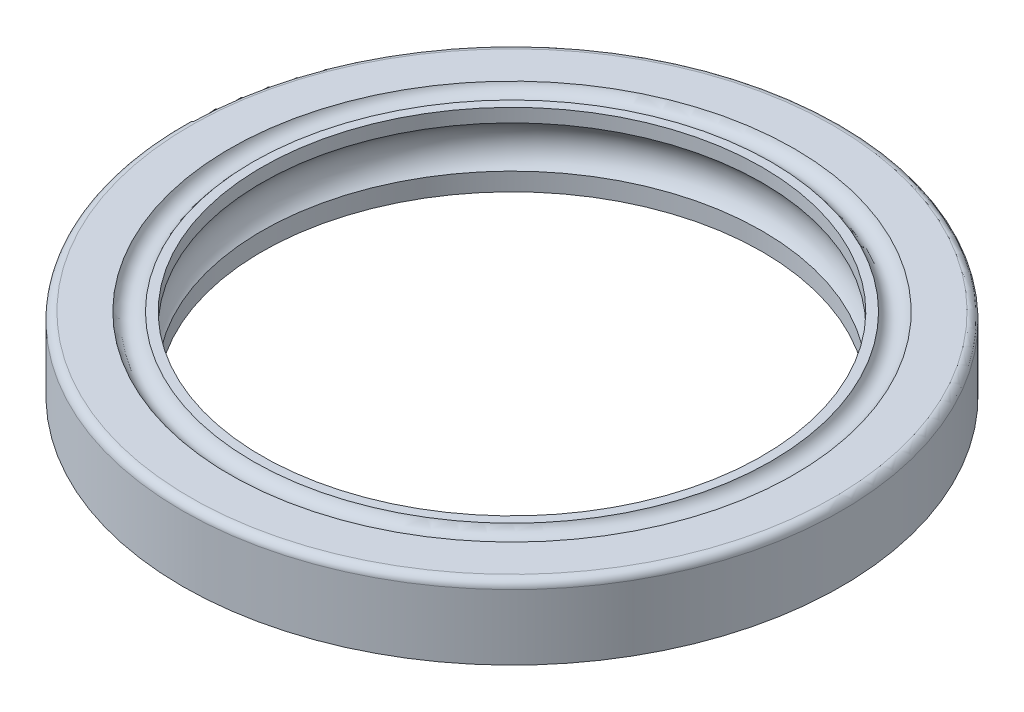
from build123d import *


with BuildPart() as part:
    # Sketch1 → Revolve1 (revolve)
    with BuildSketch(Plane.XY, mode=Mode.PRIVATE) as revolve1_sk:
        with BuildLine():
            Line((27.0002, 0), (27.0002, 5.3594))
            ThreePointArc((27.0002, 5.3594), (26.814212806, 5.808412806), (26.3652, 5.9944))
            Line((26.3652, 5.9944), (23.126763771, 5.9944))
            ThreePointArc((23.126763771, 5.9944), (22.181269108, 5.350281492), (21.235774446, 5.9944))
            Line((21.235774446, 5.9944), (20.4978, 5.9944))
            Line((20.4978, 5.9944), (20.4978, 4.890456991))
            ThreePointArc((20.4978, 4.890456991), (21.265981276, 3.18012253), (20.4978, 1.469788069))
            Line((20.4978, 1.469788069), (20.4978, 0))
            Line((20.4978, 0), (22.715415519, 0))
            Line((22.715415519, 0), (22.715415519, 4.140520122))
            Line((22.715415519, 4.140520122), (25.647789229, 4.140520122))
            Line((25.647789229, 4.140520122), (25.647789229, 0))
            Line((25.647789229, 0), (27.0002, 0))
        make_face()
    revolve(revolve1_sk.sketch.rotate(Axis((0, 0, 0), (0, 1, 0)), 90), axis=Axis((0, 0, 0), (0, 1, 0)))


solid = part.part
